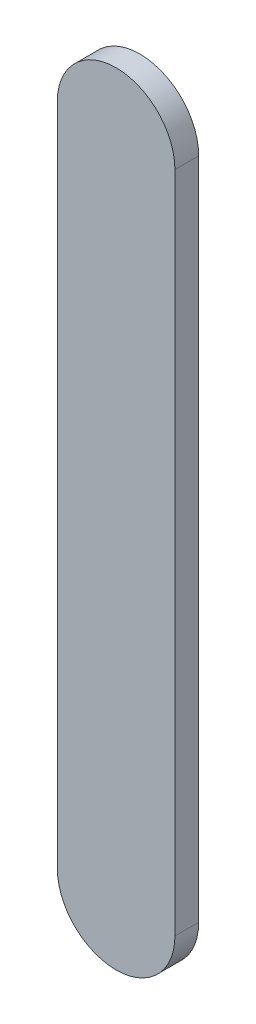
from build123d import *

# Parameters (mm, degrees)
EXTRUSION1_DEPTH = 15


with BuildPart() as part:
    # Esquisse1 → Extrusion1 (new body)
    with BuildSketch(Plane.XY):
        with BuildLine():
            Line((-37.13, 0), (-37.13, -419))
            ThreePointArc((-37.13, -419), (0, -456.13), (37.13, -419))
            Line((37.13, -419), (37.13, 0))
            ThreePointArc((37.13, 0), (0, 37.13), (-37.13, 0))
        make_face()
    extrude(amount=EXTRUSION1_DEPTH)


solid = part.part
